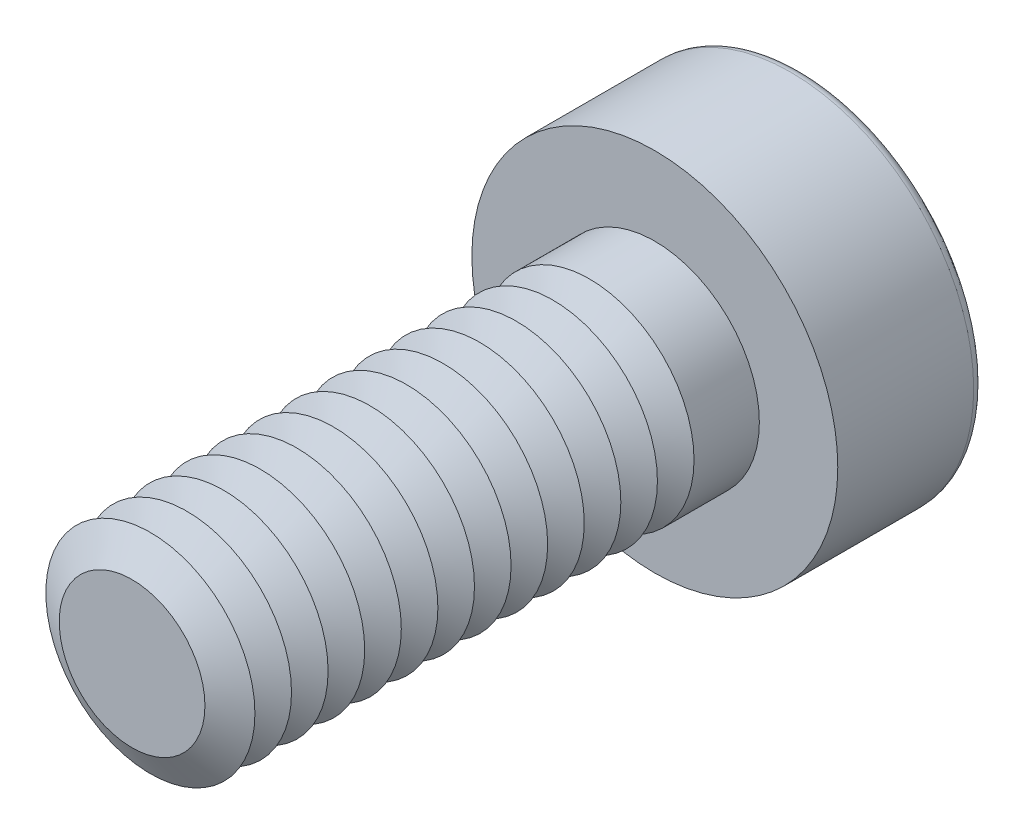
from build123d import *

# Parameters (mm, degrees)
SKETCH1_R           = 2
BOSS_EXTRUDE1_DEPTH = 10
SKETCH2_R           = 3.5
BOSS_EXTRUDE2_DEPTH = 2.8
CUT_EXTRUDE1_DEPTH  = 1.875
FILLET1_R           = 0.2
LPATTERN1_COUNT     = 13
LPATTERN1_PITCH     = 0.7


with BuildPart() as part:
    # Sketch1 → Boss-Extrude1 (new body)
    with BuildSketch(Plane.XY):
        Circle(SKETCH1_R)
    extrude(amount=BOSS_EXTRUDE1_DEPTH)

    # Sketch2 → Boss-Extrude2 (add)
    with BuildSketch(Plane(origin=(0, 0, 0), x_dir=(-1, 0, 0), z_dir=(0, 0, -1))):
        Circle(SKETCH2_R)
    extrude(amount=BOSS_EXTRUDE2_DEPTH)

    # Sketch3 → Cut-Extrude1 (cut)
    with BuildSketch(Plane(origin=(0, 0, -2.8), x_dir=(-1, 0, 0), z_dir=(0, 0, -1))):
        Polygon((-0.721687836, 1.25), (-1.443375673, 0), (-0.721687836, -1.25), (0.721687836, -1.25), (1.443375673, 0), (0.721687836, 1.25), align=None)
    extrude(amount=-CUT_EXTRUDE1_DEPTH, mode=Mode.SUBTRACT)

    # Fillet1
    fillet1_edges = [part.edges().sort_by_distance(p)[0] for p in [
        (3.5, 0, -2.8),
    ]]
    fillet(fillet1_edges, radius=FILLET1_R)

    # Cut-Extrude2 cone 1 section (on through the dimple's axis) → Cut-Extrude2 (revolve, cut)
    with BuildSketch(Plane(origin=(0, 0, -0.925), x_dir=(0, 1, 0), z_dir=(1, 0, 0))):
        Polygon((0, 0), (1.25, 0), (0, 0.721687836), align=None)
    revolve(axis=Axis((0, 0, -0.925), (0, 0, 1)), mode=Mode.SUBTRACT)

    # Cut-Extrude3 cone 1 section (on through the dimple's axis) → Cut-Extrude3 (revolve, cut)
    with BuildSketch(Plane(origin=(0, 0, -2.8), x_dir=(0, 1, 0), z_dir=(1, 0, 0))):
        Polygon((0, 0), (1.443375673, 0), (0, 0.386751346), align=None)
    revolve(axis=Axis((0, 0, -2.8), (0, 0, 1)), mode=Mode.SUBTRACT)

    # Sketch7 → Cut-Revolve1 (revolve, cut)
    with BuildSketch(Plane(origin=(0, 0, 0), x_dir=(0, 0, -1), z_dir=(1, 0, 0)), mode=Mode.PRIVATE) as cut_revolve1_sk:
        Polygon((-10, 1.393782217), (-9.65, 2), (-10.35, 2), align=None)
    cut_revolve1 = revolve(cut_revolve1_sk.sketch.rotate(Axis((0, 0, 10), (0, 0, -1)), 90), axis=Axis((0, 0, 10), (0, 0, -1)), mode=Mode.SUBTRACT)

    # LPattern1: Cut-Revolve1 ×13
    with Locations(*[(0, 0, -i * LPATTERN1_PITCH) for i in range(1, LPATTERN1_COUNT)]):
        add(cut_revolve1, mode=Mode.SUBTRACT)


solid = part.part
